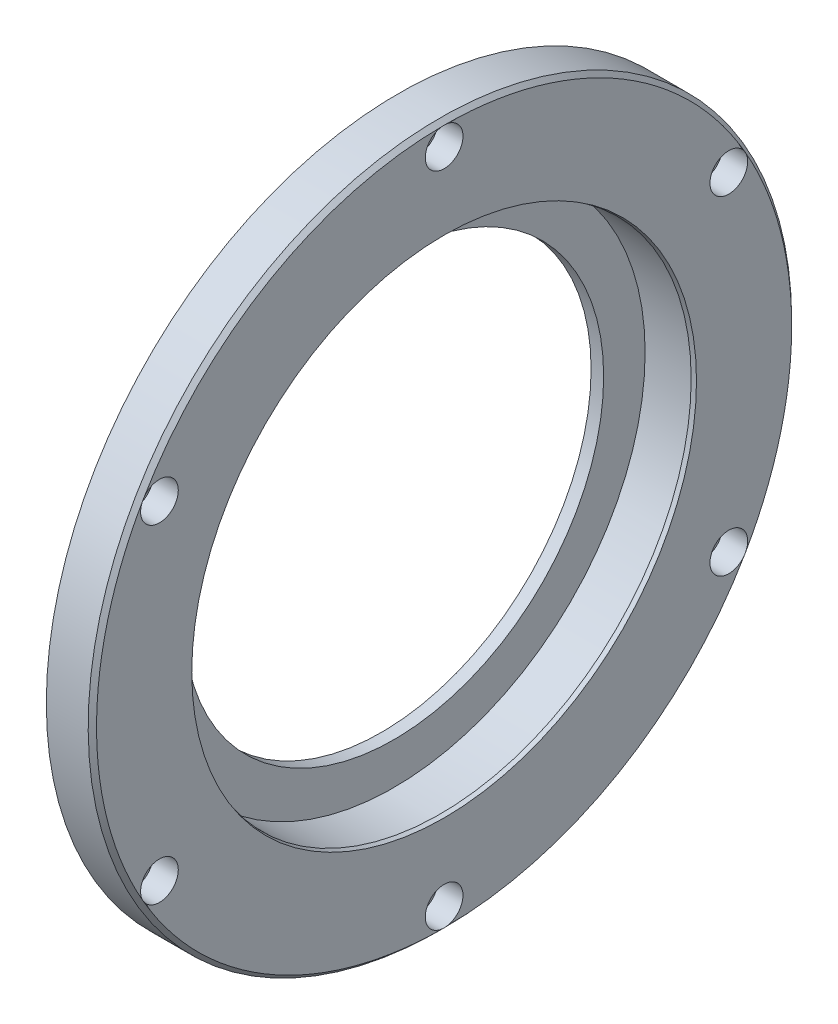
from build123d import *

# Parameters (mm, degrees)
F_1ER_LOGEMENT_VIS_D           = 6
F_1ER_LOGEMENT_VIS_CBORE_D     = 9
F_1ER_LOGEMENT_VIS_CBORE_DEPTH = 6
F_6_LOGEMENTS_VIS_COUNT        = 6


with BuildPart() as part:
    # Esquisse1 → profil (revolve)
    with BuildSketch(Plane.XY, mode=Mode.PRIVATE) as profil_sk:
        Polygon((-16, 74.422649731), (-16, 65), (-15, 65), (-15, 50.1), (-12, 50.1), (-12, 60), (-1, 60), (0, 60.267949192), (0, 83), (-1, 84), (-11, 84), (-11, 75), (-15, 75), align=None)
    revolve(profil_sk.sketch.rotate(Axis((0, 0, 0), (-1, 0, 0)), 90), axis=Axis((0, 0, 0), (-1, 0, 0)))

    # 1er logement vis (through all)
    with Locations(Plane(origin=(0, 0, 0), x_dir=(0, 0, -1), z_dir=(1, 0, 0))):
        with Locations((0, 78.5)):
            f_1er_logement_vis = CounterBoreHole(F_1ER_LOGEMENT_VIS_D / 2, F_1ER_LOGEMENT_VIS_CBORE_D / 2, F_1ER_LOGEMENT_VIS_CBORE_DEPTH)

    # 6 logements vis: 1er logement vis ×6 about axis
    f_6_logements_vis_axis = Axis((0, 0, 0), (1, 0, 0))
    for i in range(1, F_6_LOGEMENTS_VIS_COUNT):
        add(f_1er_logement_vis.rotate(f_6_logements_vis_axis, i * 360 / F_6_LOGEMENTS_VIS_COUNT), mode=Mode.SUBTRACT)


solid = part.part
